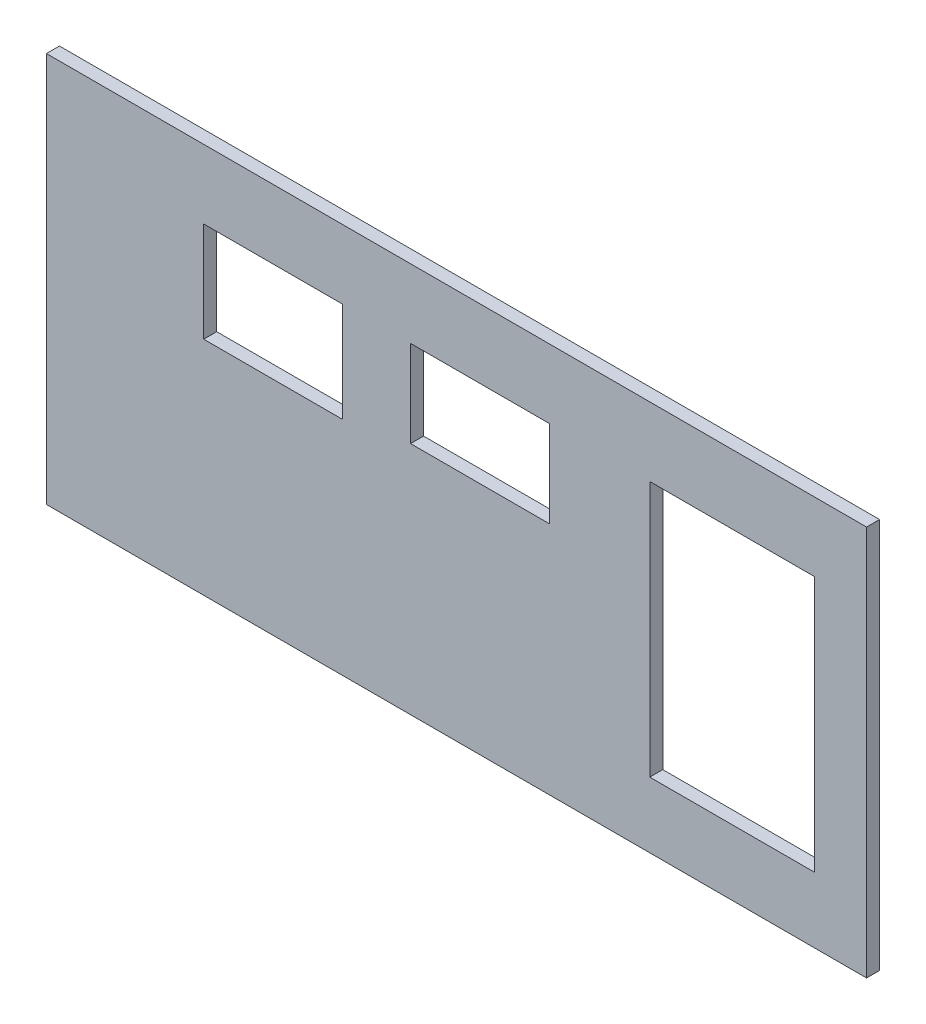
ISO-10303-21;
HEADER;
FILE_DESCRIPTION(('STEP AP214'),'2;1');
FILE_NAME('part.step','',(''),(''),'','','');
FILE_SCHEMA(('AUTOMOTIVE_DESIGN { 1 0 10303 214 1 1 1 1 }'));
ENDSEC;
DATA;
#1=APPLICATION_CONTEXT('core data for automotive mechanical design processes');
#2=APPLICATION_PROTOCOL_DEFINITION('international standard','automotive_design',2000,#1);
#3=PRODUCT_CONTEXT('',#1,'mechanical');
#4=PRODUCT('Part','Part','',(#3));
#5=PRODUCT_RELATED_PRODUCT_CATEGORY('part','',(#4));
#6=PRODUCT_DEFINITION_FORMATION('','',#4);
#7=PRODUCT_DEFINITION_CONTEXT('part definition',#1,'design');
#8=PRODUCT_DEFINITION('design','',#6,#7);
#9=PRODUCT_DEFINITION_SHAPE('','',#8);
#10=(LENGTH_UNIT() NAMED_UNIT(*) SI_UNIT(.MILLI.,.METRE.));
#11=(NAMED_UNIT(*) PLANE_ANGLE_UNIT() SI_UNIT($,.RADIAN.));
#12=(NAMED_UNIT(*) SI_UNIT($,.STERADIAN.) SOLID_ANGLE_UNIT());
#13=UNCERTAINTY_MEASURE_WITH_UNIT(LENGTH_MEASURE(1.E-05),#10,'distance_accuracy_value','');
#14=(GEOMETRIC_REPRESENTATION_CONTEXT(3) GLOBAL_UNCERTAINTY_ASSIGNED_CONTEXT((#13)) GLOBAL_UNIT_ASSIGNED_CONTEXT((#10,
#11,#12)) REPRESENTATION_CONTEXT('',''));
#15=CARTESIAN_POINT('',(0.,0.,0.));
#16=DIRECTION('',(0.,0.,1.));
#17=DIRECTION('',(1.,0.,0.));
#18=AXIS2_PLACEMENT_3D('',#15,#16,#17);
#19=CARTESIAN_POINT('',(0.,0.,3.));
#20=DIRECTION('',(0.,0.,1.));
#21=DIRECTION('',(1.,0.,0.));
#22=AXIS2_PLACEMENT_3D('',#19,#20,#21);
#23=PLANE('',#22);
#24=DIRECTION('',(0.,-1.,0.));
#25=VECTOR('',#24,1.);
#26=CARTESIAN_POINT('',(-65.9785095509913,37.2037410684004,3.));
#27=LINE('',#26,#25);
#28=CARTESIAN_POINT('',(-65.9785095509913,37.2037410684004,3.));
#29=VERTEX_POINT('',#28);
#30=CARTESIAN_POINT('',(-65.9785095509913,-52.7962589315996,3.));
#31=VERTEX_POINT('',#30);
#32=EDGE_CURVE('E244',#29,#31,#27,.T.);
#33=ORIENTED_EDGE('',*,*,#32,.T.);
#34=DIRECTION('',(1.,0.,0.));
#35=VECTOR('',#34,1.);
#36=CARTESIAN_POINT('',(-65.9785095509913,-52.7962589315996,3.));
#37=LINE('',#36,#35);
#38=CARTESIAN_POINT('',(123.021490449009,-52.7962589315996,3.));
#39=VERTEX_POINT('',#38);
#40=EDGE_CURVE('E247',#31,#39,#37,.T.);
#41=ORIENTED_EDGE('',*,*,#40,.T.);
#42=DIRECTION('',(0.,1.,0.));
#43=VECTOR('',#42,1.);
#44=CARTESIAN_POINT('',(123.021490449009,-52.7962589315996,3.));
#45=LINE('',#44,#43);
#46=CARTESIAN_POINT('',(123.021490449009,37.2037410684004,3.));
#47=VERTEX_POINT('',#46);
#48=EDGE_CURVE('E250',#39,#47,#45,.T.);
#49=ORIENTED_EDGE('',*,*,#48,.T.);
#50=DIRECTION('',(-1.,0.,0.));
#51=VECTOR('',#50,1.);
#52=CARTESIAN_POINT('',(-65.9785095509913,37.2037410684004,3.));
#53=LINE('',#52,#51);
#54=EDGE_CURVE('E252',#47,#29,#53,.T.);
#55=ORIENTED_EDGE('',*,*,#54,.T.);
#56=EDGE_LOOP('',(#33,#41,#49,#55));
#57=FACE_BOUND('',#56,.T.);
#58=DIRECTION('',(0.,-1.,0.));
#59=VECTOR('',#58,1.);
#60=CARTESIAN_POINT('',(73.0580232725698,-37.6904929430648,3.));
#61=LINE('',#60,#59);
#62=CARTESIAN_POINT('',(73.0580232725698,21.3095070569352,3.));
#63=VERTEX_POINT('',#62);
#64=CARTESIAN_POINT('',(73.0580232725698,-37.6904929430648,3.));
#65=VERTEX_POINT('',#64);
#66=EDGE_CURVE('E215',#63,#65,#61,.T.);
#67=ORIENTED_EDGE('',*,*,#66,.F.);
#68=DIRECTION('',(-1.,0.,0.));
#69=VECTOR('',#68,1.);
#70=CARTESIAN_POINT('',(73.0580232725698,21.3095070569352,3.));
#71=LINE('',#70,#69);
#72=CARTESIAN_POINT('',(111.05802327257,21.3095070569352,3.));
#73=VERTEX_POINT('',#72);
#74=EDGE_CURVE('E213',#73,#63,#71,.T.);
#75=ORIENTED_EDGE('',*,*,#74,.F.);
#76=DIRECTION('',(0.,1.,0.));
#77=VECTOR('',#76,1.);
#78=CARTESIAN_POINT('',(111.05802327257,21.3095070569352,3.));
#79=LINE('',#78,#77);
#80=CARTESIAN_POINT('',(111.05802327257,-37.6904929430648,3.));
#81=VERTEX_POINT('',#80);
#82=EDGE_CURVE('E221',#81,#73,#79,.T.);
#83=ORIENTED_EDGE('',*,*,#82,.F.);
#84=DIRECTION('',(1.,0.,0.));
#85=VECTOR('',#84,1.);
#86=CARTESIAN_POINT('',(111.05802327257,-37.6904929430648,3.));
#87=LINE('',#86,#85);
#88=EDGE_CURVE('E218',#65,#81,#87,.T.);
#89=ORIENTED_EDGE('',*,*,#88,.F.);
#90=EDGE_LOOP('',(#67,#75,#83,#89));
#91=FACE_BOUND('',#90,.T.);
#92=DIRECTION('',(1.,0.,0.));
#93=VECTOR('',#92,1.);
#94=CARTESIAN_POINT('',(49.9343730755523,1.30950705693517,3.));
#95=LINE('',#94,#93);
#96=CARTESIAN_POINT('',(17.9343730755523,1.30950705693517,3.));
#97=VERTEX_POINT('',#96);
#98=CARTESIAN_POINT('',(49.9343730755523,1.30950705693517,3.));
#99=VERTEX_POINT('',#98);
#100=EDGE_CURVE('E184',#97,#99,#95,.T.);
#101=ORIENTED_EDGE('',*,*,#100,.F.);
#102=DIRECTION('',(0.,-1.,0.));
#103=VECTOR('',#102,1.);
#104=CARTESIAN_POINT('',(17.9343730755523,1.30950705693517,3.));
#105=LINE('',#104,#103);
#106=CARTESIAN_POINT('',(17.9343730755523,21.3095070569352,3.));
#107=VERTEX_POINT('',#106);
#108=EDGE_CURVE('E182',#107,#97,#105,.T.);
#109=ORIENTED_EDGE('',*,*,#108,.F.);
#110=DIRECTION('',(-1.,0.,0.));
#111=VECTOR('',#110,1.);
#112=CARTESIAN_POINT('',(17.9343730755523,21.3095070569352,3.));
#113=LINE('',#112,#111);
#114=CARTESIAN_POINT('',(49.9343730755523,21.3095070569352,3.));
#115=VERTEX_POINT('',#114);
#116=EDGE_CURVE('E190',#115,#107,#113,.T.);
#117=ORIENTED_EDGE('',*,*,#116,.F.);
#118=DIRECTION('',(0.,1.,0.));
#119=VECTOR('',#118,1.);
#120=CARTESIAN_POINT('',(49.9343730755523,21.3095070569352,3.));
#121=LINE('',#120,#119);
#122=EDGE_CURVE('E187',#99,#115,#121,.T.);
#123=ORIENTED_EDGE('',*,*,#122,.F.);
#124=EDGE_LOOP('',(#101,#109,#117,#123));
#125=FACE_BOUND('',#124,.T.);
#126=DIRECTION('',(-1.,0.,0.));
#127=VECTOR('',#126,1.);
#128=CARTESIAN_POINT('',(2.26472390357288,21.3095070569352,3.));
#129=LINE('',#128,#127);
#130=CARTESIAN_POINT('',(2.26472390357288,21.3095070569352,3.));
#131=VERTEX_POINT('',#130);
#132=CARTESIAN_POINT('',(-29.7352760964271,21.3095070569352,3.));
#133=VERTEX_POINT('',#132);
#134=EDGE_CURVE('E154',#131,#133,#129,.T.);
#135=ORIENTED_EDGE('',*,*,#134,.F.);
#136=DIRECTION('',(0.,1.,0.));
#137=VECTOR('',#136,1.);
#138=CARTESIAN_POINT('',(2.26472390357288,-1.69049294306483,3.));
#139=LINE('',#138,#137);
#140=CARTESIAN_POINT('',(2.26472390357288,-1.69049294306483,3.));
#141=VERTEX_POINT('',#140);
#142=EDGE_CURVE('E146',#141,#131,#139,.T.);
#143=ORIENTED_EDGE('',*,*,#142,.F.);
#144=DIRECTION('',(1.,0.,0.));
#145=VECTOR('',#144,1.);
#146=CARTESIAN_POINT('',(-29.7352760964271,-1.69049294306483,3.));
#147=LINE('',#146,#145);
#148=CARTESIAN_POINT('',(-29.7352760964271,-1.69049294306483,3.));
#149=VERTEX_POINT('',#148);
#150=EDGE_CURVE('E168',#149,#141,#147,.T.);
#151=ORIENTED_EDGE('',*,*,#150,.F.);
#152=DIRECTION('',(0.,-1.,0.));
#153=VECTOR('',#152,1.);
#154=CARTESIAN_POINT('',(-29.7352760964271,21.3095070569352,3.));
#155=LINE('',#154,#153);
#156=EDGE_CURVE('E166',#133,#149,#155,.T.);
#157=ORIENTED_EDGE('',*,*,#156,.F.);
#158=EDGE_LOOP('',(#135,#143,#151,#157));
#159=FACE_BOUND('',#158,.T.);
#160=ADVANCED_FACE('F33',(#57,#91,#125,#159),#23,.T.);
#161=CARTESIAN_POINT('',(0.,0.,0.));
#162=DIRECTION('',(0.,0.,1.));
#163=DIRECTION('',(1.,0.,0.));
#164=AXIS2_PLACEMENT_3D('',#161,#162,#163);
#165=PLANE('',#164);
#166=DIRECTION('',(0.,-1.,0.));
#167=VECTOR('',#166,1.);
#168=CARTESIAN_POINT('',(17.9343730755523,1.30950705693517,0.));
#169=LINE('',#168,#167);
#170=CARTESIAN_POINT('',(17.9343730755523,21.3095070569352,0.));
#171=VERTEX_POINT('',#170);
#172=CARTESIAN_POINT('',(17.9343730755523,1.30950705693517,0.));
#173=VERTEX_POINT('',#172);
#174=EDGE_CURVE('E162',#171,#173,#169,.T.);
#175=ORIENTED_EDGE('',*,*,#174,.T.);
#176=DIRECTION('',(1.,0.,0.));
#177=VECTOR('',#176,1.);
#178=CARTESIAN_POINT('',(49.9343730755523,1.30950705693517,0.));
#179=LINE('',#178,#177);
#180=CARTESIAN_POINT('',(49.9343730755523,1.30950705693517,0.));
#181=VERTEX_POINT('',#180);
#182=EDGE_CURVE('E195',#173,#181,#179,.T.);
#183=ORIENTED_EDGE('',*,*,#182,.T.);
#184=DIRECTION('',(0.,1.,0.));
#185=VECTOR('',#184,1.);
#186=CARTESIAN_POINT('',(49.9343730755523,21.3095070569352,0.));
#187=LINE('',#186,#185);
#188=CARTESIAN_POINT('',(49.9343730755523,21.3095070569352,0.));
#189=VERTEX_POINT('',#188);
#190=EDGE_CURVE('E198',#181,#189,#187,.T.);
#191=ORIENTED_EDGE('',*,*,#190,.T.);
#192=DIRECTION('',(-1.,0.,0.));
#193=VECTOR('',#192,1.);
#194=CARTESIAN_POINT('',(17.9343730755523,21.3095070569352,0.));
#195=LINE('',#194,#193);
#196=EDGE_CURVE('E185',#189,#171,#195,.T.);
#197=ORIENTED_EDGE('',*,*,#196,.T.);
#198=EDGE_LOOP('',(#175,#183,#191,#197));
#199=FACE_BOUND('',#198,.T.);
#200=DIRECTION('',(0.,-1.,0.));
#201=VECTOR('',#200,1.);
#202=CARTESIAN_POINT('',(-65.9785095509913,37.2037410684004,0.));
#203=LINE('',#202,#201);
#204=CARTESIAN_POINT('',(-65.9785095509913,37.2037410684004,0.));
#205=VERTEX_POINT('',#204);
#206=CARTESIAN_POINT('',(-65.9785095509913,-52.7962589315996,0.));
#207=VERTEX_POINT('',#206);
#208=EDGE_CURVE('E243',#205,#207,#203,.T.);
#209=ORIENTED_EDGE('',*,*,#208,.F.);
#210=DIRECTION('',(-1.,0.,0.));
#211=VECTOR('',#210,1.);
#212=CARTESIAN_POINT('',(-65.9785095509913,37.2037410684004,0.));
#213=LINE('',#212,#211);
#214=CARTESIAN_POINT('',(123.021490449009,37.2037410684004,0.));
#215=VERTEX_POINT('',#214);
#216=EDGE_CURVE('E248',#215,#205,#213,.T.);
#217=ORIENTED_EDGE('',*,*,#216,.F.);
#218=DIRECTION('',(0.,1.,0.));
#219=VECTOR('',#218,1.);
#220=CARTESIAN_POINT('',(123.021490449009,-52.7962589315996,0.));
#221=LINE('',#220,#219);
#222=CARTESIAN_POINT('',(123.021490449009,-52.7962589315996,0.));
#223=VERTEX_POINT('',#222);
#224=EDGE_CURVE('E259',#223,#215,#221,.T.);
#225=ORIENTED_EDGE('',*,*,#224,.F.);
#226=DIRECTION('',(1.,0.,0.));
#227=VECTOR('',#226,1.);
#228=CARTESIAN_POINT('',(-65.9785095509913,-52.7962589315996,0.));
#229=LINE('',#228,#227);
#230=EDGE_CURVE('E257',#207,#223,#229,.T.);
#231=ORIENTED_EDGE('',*,*,#230,.F.);
#232=EDGE_LOOP('',(#209,#217,#225,#231));
#233=FACE_BOUND('',#232,.T.);
#234=DIRECTION('',(-1.,0.,0.));
#235=VECTOR('',#234,1.);
#236=CARTESIAN_POINT('',(73.0580232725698,21.3095070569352,0.));
#237=LINE('',#236,#235);
#238=CARTESIAN_POINT('',(111.05802327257,21.3095070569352,0.));
#239=VERTEX_POINT('',#238);
#240=CARTESIAN_POINT('',(73.0580232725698,21.3095070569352,0.));
#241=VERTEX_POINT('',#240);
#242=EDGE_CURVE('E212',#239,#241,#237,.T.);
#243=ORIENTED_EDGE('',*,*,#242,.T.);
#244=DIRECTION('',(0.,-1.,0.));
#245=VECTOR('',#244,1.);
#246=CARTESIAN_POINT('',(73.0580232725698,-37.6904929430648,0.));
#247=LINE('',#246,#245);
#248=CARTESIAN_POINT('',(73.0580232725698,-37.6904929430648,0.));
#249=VERTEX_POINT('',#248);
#250=EDGE_CURVE('E226',#241,#249,#247,.T.);
#251=ORIENTED_EDGE('',*,*,#250,.T.);
#252=DIRECTION('',(1.,0.,0.));
#253=VECTOR('',#252,1.);
#254=CARTESIAN_POINT('',(111.05802327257,-37.6904929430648,0.));
#255=LINE('',#254,#253);
#256=CARTESIAN_POINT('',(111.05802327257,-37.6904929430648,0.));
#257=VERTEX_POINT('',#256);
#258=EDGE_CURVE('E229',#249,#257,#255,.T.);
#259=ORIENTED_EDGE('',*,*,#258,.T.);
#260=DIRECTION('',(0.,1.,0.));
#261=VECTOR('',#260,1.);
#262=CARTESIAN_POINT('',(111.05802327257,21.3095070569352,0.));
#263=LINE('',#262,#261);
#264=EDGE_CURVE('E216',#257,#239,#263,.T.);
#265=ORIENTED_EDGE('',*,*,#264,.T.);
#266=EDGE_LOOP('',(#243,#251,#259,#265));
#267=FACE_BOUND('',#266,.T.);
#268=DIRECTION('',(0.,1.,0.));
#269=VECTOR('',#268,1.);
#270=CARTESIAN_POINT('',(2.26472390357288,-1.69049294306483,0.));
#271=LINE('',#270,#269);
#272=CARTESIAN_POINT('',(2.26472390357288,-1.69049294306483,0.));
#273=VERTEX_POINT('',#272);
#274=CARTESIAN_POINT('',(2.26472390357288,21.3095070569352,0.));
#275=VERTEX_POINT('',#274);
#276=EDGE_CURVE('E56',#273,#275,#271,.T.);
#277=ORIENTED_EDGE('',*,*,#276,.T.);
#278=DIRECTION('',(-1.,0.,0.));
#279=VECTOR('',#278,1.);
#280=CARTESIAN_POINT('',(2.26472390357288,21.3095070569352,0.));
#281=LINE('',#280,#279);
#282=CARTESIAN_POINT('',(-29.7352760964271,21.3095070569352,0.));
#283=VERTEX_POINT('',#282);
#284=EDGE_CURVE('E161',#275,#283,#281,.T.);
#285=ORIENTED_EDGE('',*,*,#284,.T.);
#286=DIRECTION('',(0.,-1.,0.));
#287=VECTOR('',#286,1.);
#288=CARTESIAN_POINT('',(-29.7352760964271,21.3095070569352,0.));
#289=LINE('',#288,#287);
#290=CARTESIAN_POINT('',(-29.7352760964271,-1.69049294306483,0.));
#291=VERTEX_POINT('',#290);
#292=EDGE_CURVE('E174',#283,#291,#289,.T.);
#293=ORIENTED_EDGE('',*,*,#292,.T.);
#294=DIRECTION('',(1.,0.,0.));
#295=VECTOR('',#294,1.);
#296=CARTESIAN_POINT('',(-29.7352760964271,-1.69049294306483,0.));
#297=LINE('',#296,#295);
#298=EDGE_CURVE('E155',#291,#273,#297,.T.);
#299=ORIENTED_EDGE('',*,*,#298,.T.);
#300=EDGE_LOOP('',(#277,#285,#293,#299));
#301=FACE_BOUND('',#300,.T.);
#302=ADVANCED_FACE('F277',(#199,#233,#267,#301),#165,.F.);
#303=CARTESIAN_POINT('',(-65.9785095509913,37.2037410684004,3.));
#304=DIRECTION('',(1.,0.,0.));
#305=DIRECTION('',(0.,1.,0.));
#306=AXIS2_PLACEMENT_3D('',#303,#304,#305);
#307=PLANE('',#306);
#308=ORIENTED_EDGE('',*,*,#208,.T.);
#309=DIRECTION('',(0.,0.,-1.));
#310=VECTOR('',#309,1.);
#311=CARTESIAN_POINT('',(-65.9785095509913,-52.7962589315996,3.));
#312=LINE('',#311,#310);
#313=EDGE_CURVE('E11',#31,#207,#312,.T.);
#314=ORIENTED_EDGE('',*,*,#313,.F.);
#315=ORIENTED_EDGE('',*,*,#32,.F.);
#316=DIRECTION('',(0.,0.,-1.));
#317=VECTOR('',#316,1.);
#318=CARTESIAN_POINT('',(-65.9785095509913,37.2037410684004,3.));
#319=LINE('',#318,#317);
#320=EDGE_CURVE('E254',#29,#205,#319,.T.);
#321=ORIENTED_EDGE('',*,*,#320,.T.);
#322=EDGE_LOOP('',(#308,#314,#315,#321));
#323=FACE_BOUND('',#322,.T.);
#324=ADVANCED_FACE('F35',(#323),#307,.F.);
#325=CARTESIAN_POINT('',(-65.9785095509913,-52.7962589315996,3.));
#326=DIRECTION('',(0.,1.,0.));
#327=DIRECTION('',(0.,0.,1.));
#328=AXIS2_PLACEMENT_3D('',#325,#326,#327);
#329=PLANE('',#328);
#330=ORIENTED_EDGE('',*,*,#230,.T.);
#331=DIRECTION('',(0.,0.,-1.));
#332=VECTOR('',#331,1.);
#333=CARTESIAN_POINT('',(123.021490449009,-52.7962589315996,3.));
#334=LINE('',#333,#332);
#335=EDGE_CURVE('E41',#39,#223,#334,.T.);
#336=ORIENTED_EDGE('',*,*,#335,.F.);
#337=ORIENTED_EDGE('',*,*,#40,.F.);
#338=ORIENTED_EDGE('',*,*,#313,.T.);
#339=EDGE_LOOP('',(#330,#336,#337,#338));
#340=FACE_BOUND('',#339,.T.);
#341=ADVANCED_FACE('F288',(#340),#329,.F.);
#342=CARTESIAN_POINT('',(123.021490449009,-52.7962589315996,3.));
#343=DIRECTION('',(-1.,0.,0.));
#344=DIRECTION('',(0.,0.,1.));
#345=AXIS2_PLACEMENT_3D('',#342,#343,#344);
#346=PLANE('',#345);
#347=ORIENTED_EDGE('',*,*,#224,.T.);
#348=DIRECTION('',(0.,0.,-1.));
#349=VECTOR('',#348,1.);
#350=CARTESIAN_POINT('',(123.021490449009,37.2037410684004,3.));
#351=LINE('',#350,#349);
#352=EDGE_CURVE('E264',#47,#215,#351,.T.);
#353=ORIENTED_EDGE('',*,*,#352,.F.);
#354=ORIENTED_EDGE('',*,*,#48,.F.);
#355=ORIENTED_EDGE('',*,*,#335,.T.);
#356=EDGE_LOOP('',(#347,#353,#354,#355));
#357=FACE_BOUND('',#356,.T.);
#358=ADVANCED_FACE('F271',(#357),#346,.F.);
#359=CARTESIAN_POINT('',(-65.9785095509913,37.2037410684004,3.));
#360=DIRECTION('',(0.,-1.,0.));
#361=DIRECTION('',(0.,0.,-1.));
#362=AXIS2_PLACEMENT_3D('',#359,#360,#361);
#363=PLANE('',#362);
#364=ORIENTED_EDGE('',*,*,#216,.T.);
#365=ORIENTED_EDGE('',*,*,#320,.F.);
#366=ORIENTED_EDGE('',*,*,#54,.F.);
#367=ORIENTED_EDGE('',*,*,#352,.T.);
#368=EDGE_LOOP('',(#364,#365,#366,#367));
#369=FACE_BOUND('',#368,.T.);
#370=ADVANCED_FACE('F281',(#369),#363,.F.);
#371=CARTESIAN_POINT('',(73.0580232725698,21.3095070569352,3.));
#372=DIRECTION('',(0.,-1.,0.));
#373=DIRECTION('',(0.,0.,-1.));
#374=AXIS2_PLACEMENT_3D('',#371,#372,#373);
#375=PLANE('',#374);
#376=ORIENTED_EDGE('',*,*,#242,.F.);
#377=DIRECTION('',(0.,0.,-1.));
#378=VECTOR('',#377,1.);
#379=CARTESIAN_POINT('',(111.05802327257,21.3095070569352,3.));
#380=LINE('',#379,#378);
#381=EDGE_CURVE('E223',#73,#239,#380,.T.);
#382=ORIENTED_EDGE('',*,*,#381,.F.);
#383=ORIENTED_EDGE('',*,*,#74,.T.);
#384=DIRECTION('',(0.,0.,-1.));
#385=VECTOR('',#384,1.);
#386=CARTESIAN_POINT('',(73.0580232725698,21.3095070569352,3.));
#387=LINE('',#386,#385);
#388=EDGE_CURVE('E240',#63,#241,#387,.T.);
#389=ORIENTED_EDGE('',*,*,#388,.T.);
#390=EDGE_LOOP('',(#376,#382,#383,#389));
#391=FACE_BOUND('',#390,.T.);
#392=ADVANCED_FACE('F303',(#391),#375,.T.);
#393=CARTESIAN_POINT('',(73.0580232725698,-37.6904929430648,3.));
#394=DIRECTION('',(1.,0.,0.));
#395=DIRECTION('',(0.,0.,-1.));
#396=AXIS2_PLACEMENT_3D('',#393,#394,#395);
#397=PLANE('',#396);
#398=ORIENTED_EDGE('',*,*,#250,.F.);
#399=ORIENTED_EDGE('',*,*,#388,.F.);
#400=ORIENTED_EDGE('',*,*,#66,.T.);
#401=DIRECTION('',(0.,0.,-1.));
#402=VECTOR('',#401,1.);
#403=CARTESIAN_POINT('',(73.0580232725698,-37.6904929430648,3.));
#404=LINE('',#403,#402);
#405=EDGE_CURVE('E238',#65,#249,#404,.T.);
#406=ORIENTED_EDGE('',*,*,#405,.T.);
#407=EDGE_LOOP('',(#398,#399,#400,#406));
#408=FACE_BOUND('',#407,.T.);
#409=ADVANCED_FACE('F310',(#408),#397,.T.);
#410=CARTESIAN_POINT('',(111.05802327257,-37.6904929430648,3.));
#411=DIRECTION('',(0.,1.,0.));
#412=DIRECTION('',(-1.,0.,0.));
#413=AXIS2_PLACEMENT_3D('',#410,#411,#412);
#414=PLANE('',#413);
#415=ORIENTED_EDGE('',*,*,#258,.F.);
#416=ORIENTED_EDGE('',*,*,#405,.F.);
#417=ORIENTED_EDGE('',*,*,#88,.T.);
#418=DIRECTION('',(0.,0.,-1.));
#419=VECTOR('',#418,1.);
#420=CARTESIAN_POINT('',(111.05802327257,-37.6904929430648,3.));
#421=LINE('',#420,#419);
#422=EDGE_CURVE('E236',#81,#257,#421,.T.);
#423=ORIENTED_EDGE('',*,*,#422,.T.);
#424=EDGE_LOOP('',(#415,#416,#417,#423));
#425=FACE_BOUND('',#424,.T.);
#426=ADVANCED_FACE('F315',(#425),#414,.T.);
#427=CARTESIAN_POINT('',(111.05802327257,21.3095070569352,3.));
#428=DIRECTION('',(-1.,0.,0.));
#429=DIRECTION('',(0.,0.,1.));
#430=AXIS2_PLACEMENT_3D('',#427,#428,#429);
#431=PLANE('',#430);
#432=ORIENTED_EDGE('',*,*,#264,.F.);
#433=ORIENTED_EDGE('',*,*,#422,.F.);
#434=ORIENTED_EDGE('',*,*,#82,.T.);
#435=ORIENTED_EDGE('',*,*,#381,.T.);
#436=EDGE_LOOP('',(#432,#433,#434,#435));
#437=FACE_BOUND('',#436,.T.);
#438=ADVANCED_FACE('F322',(#437),#431,.T.);
#439=CARTESIAN_POINT('',(17.9343730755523,1.30950705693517,3.));
#440=DIRECTION('',(1.,0.,0.));
#441=DIRECTION('',(0.,0.,-1.));
#442=AXIS2_PLACEMENT_3D('',#439,#440,#441);
#443=PLANE('',#442);
#444=ORIENTED_EDGE('',*,*,#174,.F.);
#445=DIRECTION('',(0.,0.,-1.));
#446=VECTOR('',#445,1.);
#447=CARTESIAN_POINT('',(17.9343730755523,21.3095070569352,3.));
#448=LINE('',#447,#446);
#449=EDGE_CURVE('E192',#107,#171,#448,.T.);
#450=ORIENTED_EDGE('',*,*,#449,.F.);
#451=ORIENTED_EDGE('',*,*,#108,.T.);
#452=DIRECTION('',(0.,0.,-1.));
#453=VECTOR('',#452,1.);
#454=CARTESIAN_POINT('',(17.9343730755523,1.30950705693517,3.));
#455=LINE('',#454,#453);
#456=EDGE_CURVE('E209',#97,#173,#455,.T.);
#457=ORIENTED_EDGE('',*,*,#456,.T.);
#458=EDGE_LOOP('',(#444,#450,#451,#457));
#459=FACE_BOUND('',#458,.T.);
#460=ADVANCED_FACE('F344',(#459),#443,.T.);
#461=CARTESIAN_POINT('',(49.9343730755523,1.30950705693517,3.));
#462=DIRECTION('',(0.,1.,0.));
#463=DIRECTION('',(0.,0.,1.));
#464=AXIS2_PLACEMENT_3D('',#461,#462,#463);
#465=PLANE('',#464);
#466=ORIENTED_EDGE('',*,*,#182,.F.);
#467=ORIENTED_EDGE('',*,*,#456,.F.);
#468=ORIENTED_EDGE('',*,*,#100,.T.);
#469=DIRECTION('',(0.,0.,-1.));
#470=VECTOR('',#469,1.);
#471=CARTESIAN_POINT('',(49.9343730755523,1.30950705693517,3.));
#472=LINE('',#471,#470);
#473=EDGE_CURVE('E207',#99,#181,#472,.T.);
#474=ORIENTED_EDGE('',*,*,#473,.T.);
#475=EDGE_LOOP('',(#466,#467,#468,#474));
#476=FACE_BOUND('',#475,.T.);
#477=ADVANCED_FACE('F338',(#476),#465,.T.);
#478=CARTESIAN_POINT('',(49.9343730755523,21.3095070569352,3.));
#479=DIRECTION('',(-1.,0.,0.));
#480=DIRECTION('',(0.,0.,1.));
#481=AXIS2_PLACEMENT_3D('',#478,#479,#480);
#482=PLANE('',#481);
#483=ORIENTED_EDGE('',*,*,#190,.F.);
#484=ORIENTED_EDGE('',*,*,#473,.F.);
#485=ORIENTED_EDGE('',*,*,#122,.T.);
#486=DIRECTION('',(0.,0.,-1.));
#487=VECTOR('',#486,1.);
#488=CARTESIAN_POINT('',(49.9343730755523,21.3095070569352,3.));
#489=LINE('',#488,#487);
#490=EDGE_CURVE('E205',#115,#189,#489,.T.);
#491=ORIENTED_EDGE('',*,*,#490,.T.);
#492=EDGE_LOOP('',(#483,#484,#485,#491));
#493=FACE_BOUND('',#492,.T.);
#494=ADVANCED_FACE('F341',(#493),#482,.T.);
#495=CARTESIAN_POINT('',(17.9343730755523,21.3095070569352,3.));
#496=DIRECTION('',(0.,-1.,0.));
#497=DIRECTION('',(0.,0.,-1.));
#498=AXIS2_PLACEMENT_3D('',#495,#496,#497);
#499=PLANE('',#498);
#500=ORIENTED_EDGE('',*,*,#196,.F.);
#501=ORIENTED_EDGE('',*,*,#490,.F.);
#502=ORIENTED_EDGE('',*,*,#116,.T.);
#503=ORIENTED_EDGE('',*,*,#449,.T.);
#504=EDGE_LOOP('',(#500,#501,#502,#503));
#505=FACE_BOUND('',#504,.T.);
#506=ADVANCED_FACE('F347',(#505),#499,.T.);
#507=CARTESIAN_POINT('',(2.26472390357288,-1.69049294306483,3.));
#508=DIRECTION('',(-1.,0.,0.));
#509=DIRECTION('',(0.,0.,1.));
#510=AXIS2_PLACEMENT_3D('',#507,#508,#509);
#511=PLANE('',#510);
#512=ORIENTED_EDGE('',*,*,#276,.F.);
#513=DIRECTION('',(0.,0.,-1.));
#514=VECTOR('',#513,1.);
#515=CARTESIAN_POINT('',(2.26472390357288,-1.69049294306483,3.));
#516=LINE('',#515,#514);
#517=EDGE_CURVE('E150',#141,#273,#516,.T.);
#518=ORIENTED_EDGE('',*,*,#517,.F.);
#519=ORIENTED_EDGE('',*,*,#142,.T.);
#520=DIRECTION('',(0.,0.,-1.));
#521=VECTOR('',#520,1.);
#522=CARTESIAN_POINT('',(2.26472390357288,21.3095070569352,3.));
#523=LINE('',#522,#521);
#524=EDGE_CURVE('E149',#131,#275,#523,.T.);
#525=ORIENTED_EDGE('',*,*,#524,.T.);
#526=EDGE_LOOP('',(#512,#518,#519,#525));
#527=FACE_BOUND('',#526,.T.);
#528=ADVANCED_FACE('F148',(#527),#511,.T.);
#529=CARTESIAN_POINT('',(2.26472390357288,21.3095070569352,3.));
#530=DIRECTION('',(0.,-1.,0.));
#531=DIRECTION('',(0.,0.,-1.));
#532=AXIS2_PLACEMENT_3D('',#529,#530,#531);
#533=PLANE('',#532);
#534=ORIENTED_EDGE('',*,*,#284,.F.);
#535=ORIENTED_EDGE('',*,*,#524,.F.);
#536=ORIENTED_EDGE('',*,*,#134,.T.);
#537=DIRECTION('',(0.,0.,-1.));
#538=VECTOR('',#537,1.);
#539=CARTESIAN_POINT('',(-29.7352760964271,21.3095070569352,3.));
#540=LINE('',#539,#538);
#541=EDGE_CURVE('E163',#133,#283,#540,.T.);
#542=ORIENTED_EDGE('',*,*,#541,.T.);
#543=EDGE_LOOP('',(#534,#535,#536,#542));
#544=FACE_BOUND('',#543,.T.);
#545=ADVANCED_FACE('F158',(#544),#533,.T.);
#546=CARTESIAN_POINT('',(-29.7352760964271,21.3095070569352,3.));
#547=DIRECTION('',(1.,0.,0.));
#548=DIRECTION('',(0.,1.,0.));
#549=AXIS2_PLACEMENT_3D('',#546,#547,#548);
#550=PLANE('',#549);
#551=ORIENTED_EDGE('',*,*,#292,.F.);
#552=ORIENTED_EDGE('',*,*,#541,.F.);
#553=ORIENTED_EDGE('',*,*,#156,.T.);
#554=DIRECTION('',(0.,0.,-1.));
#555=VECTOR('',#554,1.);
#556=CARTESIAN_POINT('',(-29.7352760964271,-1.69049294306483,3.));
#557=LINE('',#556,#555);
#558=EDGE_CURVE('E48',#149,#291,#557,.T.);
#559=ORIENTED_EDGE('',*,*,#558,.T.);
#560=EDGE_LOOP('',(#551,#552,#553,#559));
#561=FACE_BOUND('',#560,.T.);
#562=ADVANCED_FACE('F404',(#561),#550,.T.);
#563=CARTESIAN_POINT('',(-29.7352760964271,-1.69049294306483,3.));
#564=DIRECTION('',(0.,1.,0.));
#565=DIRECTION('',(0.,0.,1.));
#566=AXIS2_PLACEMENT_3D('',#563,#564,#565);
#567=PLANE('',#566);
#568=ORIENTED_EDGE('',*,*,#298,.F.);
#569=ORIENTED_EDGE('',*,*,#558,.F.);
#570=ORIENTED_EDGE('',*,*,#150,.T.);
#571=ORIENTED_EDGE('',*,*,#517,.T.);
#572=EDGE_LOOP('',(#568,#569,#570,#571));
#573=FACE_BOUND('',#572,.T.);
#574=ADVANCED_FACE('F412',(#573),#567,.T.);
#575=CLOSED_SHELL('',(#160,#302,#324,#341,#358,#370,#392,#409,#426,#438,#460,#477,#494,#506,
#528,#545,#562,#574));
#576=MANIFOLD_SOLID_BREP('B2',#575);
#577=ADVANCED_BREP_SHAPE_REPRESENTATION('',(#18,#576),#14);
#578=SHAPE_DEFINITION_REPRESENTATION(#9,#577);
ENDSEC;
END-ISO-10303-21;
